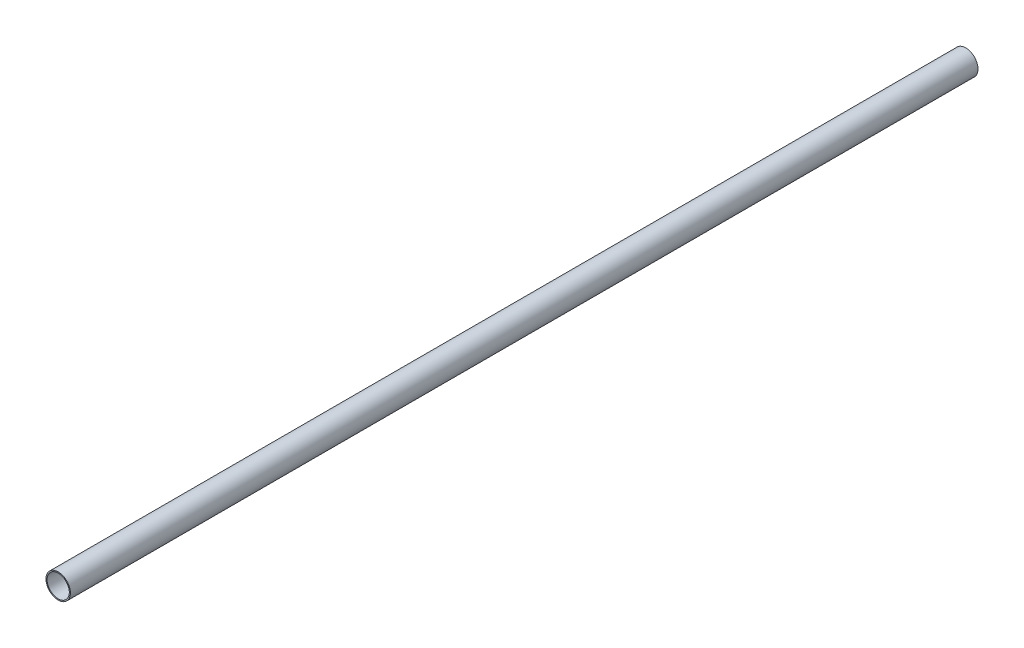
ISO-10303-21;
HEADER;
FILE_DESCRIPTION(('STEP AP214'),'2;1');
FILE_NAME('part.step','',(''),(''),'','','');
FILE_SCHEMA(('AUTOMOTIVE_DESIGN { 1 0 10303 214 1 1 1 1 }'));
ENDSEC;
DATA;
#1=APPLICATION_CONTEXT('core data for automotive mechanical design processes');
#2=APPLICATION_PROTOCOL_DEFINITION('international standard','automotive_design',2000,#1);
#3=PRODUCT_CONTEXT('',#1,'mechanical');
#4=PRODUCT('Part','Part','',(#3));
#5=PRODUCT_RELATED_PRODUCT_CATEGORY('part','',(#4));
#6=PRODUCT_DEFINITION_FORMATION('','',#4);
#7=PRODUCT_DEFINITION_CONTEXT('part definition',#1,'design');
#8=PRODUCT_DEFINITION('design','',#6,#7);
#9=PRODUCT_DEFINITION_SHAPE('','',#8);
#10=(LENGTH_UNIT() NAMED_UNIT(*) SI_UNIT(.MILLI.,.METRE.));
#11=(NAMED_UNIT(*) PLANE_ANGLE_UNIT() SI_UNIT($,.RADIAN.));
#12=(NAMED_UNIT(*) SI_UNIT($,.STERADIAN.) SOLID_ANGLE_UNIT());
#13=UNCERTAINTY_MEASURE_WITH_UNIT(LENGTH_MEASURE(1.E-05),#10,'distance_accuracy_value','');
#14=(GEOMETRIC_REPRESENTATION_CONTEXT(3) GLOBAL_UNCERTAINTY_ASSIGNED_CONTEXT((#13)) GLOBAL_UNIT_ASSIGNED_CONTEXT((#10,
#11,#12)) REPRESENTATION_CONTEXT('',''));
#15=CARTESIAN_POINT('',(0.,0.,0.));
#16=DIRECTION('',(0.,0.,1.));
#17=DIRECTION('',(1.,0.,0.));
#18=AXIS2_PLACEMENT_3D('',#15,#16,#17);
#19=CARTESIAN_POINT('',(0.,0.,122.5));
#20=DIRECTION('',(0.,0.,1.));
#21=DIRECTION('',(1.,0.,0.));
#22=AXIS2_PLACEMENT_3D('',#19,#20,#21);
#23=PLANE('',#22);
#24=CARTESIAN_POINT('',(0.,0.,122.5));
#25=DIRECTION('',(0.,0.,1.));
#26=DIRECTION('',(1.,0.,0.));
#27=AXIS2_PLACEMENT_3D('',#24,#25,#26);
#28=CIRCLE('',#27,3.3);
#29=CARTESIAN_POINT('',(3.3,0.,122.5));
#30=VERTEX_POINT('',#29);
#31=EDGE_CURVE('E10',#30,#30,#28,.T.);
#32=ORIENTED_EDGE('',*,*,#31,.T.);
#33=EDGE_LOOP('',(#32));
#34=FACE_BOUND('',#33,.T.);
#35=CARTESIAN_POINT('',(0.,0.,122.5));
#36=DIRECTION('',(0.,0.,1.));
#37=DIRECTION('',(1.,0.,0.));
#38=AXIS2_PLACEMENT_3D('',#35,#36,#37);
#39=CIRCLE('',#38,3.);
#40=CARTESIAN_POINT('',(3.,0.,122.5));
#41=VERTEX_POINT('',#40);
#42=EDGE_CURVE('E44',#41,#41,#39,.T.);
#43=ORIENTED_EDGE('',*,*,#42,.F.);
#44=EDGE_LOOP('',(#43));
#45=FACE_BOUND('',#44,.T.);
#46=ADVANCED_FACE('F33',(#34,#45),#23,.T.);
#47=CARTESIAN_POINT('',(0.,0.,-122.5));
#48=DIRECTION('',(0.,0.,1.));
#49=DIRECTION('',(1.,0.,0.));
#50=AXIS2_PLACEMENT_3D('',#47,#48,#49);
#51=PLANE('',#50);
#52=CARTESIAN_POINT('',(0.,0.,-122.5));
#53=DIRECTION('',(0.,0.,1.));
#54=DIRECTION('',(1.,0.,0.));
#55=AXIS2_PLACEMENT_3D('',#52,#53,#54);
#56=CIRCLE('',#55,3.3);
#57=CARTESIAN_POINT('',(3.3,0.,-122.5));
#58=VERTEX_POINT('',#57);
#59=EDGE_CURVE('E37',#58,#58,#56,.T.);
#60=ORIENTED_EDGE('',*,*,#59,.F.);
#61=EDGE_LOOP('',(#60));
#62=FACE_BOUND('',#61,.T.);
#63=CARTESIAN_POINT('',(0.,0.,-122.5));
#64=DIRECTION('',(0.,0.,1.));
#65=DIRECTION('',(1.,0.,0.));
#66=AXIS2_PLACEMENT_3D('',#63,#64,#65);
#67=CIRCLE('',#66,3.);
#68=CARTESIAN_POINT('',(3.,0.,-122.5));
#69=VERTEX_POINT('',#68);
#70=EDGE_CURVE('E46',#69,#69,#67,.T.);
#71=ORIENTED_EDGE('',*,*,#70,.T.);
#72=EDGE_LOOP('',(#71));
#73=FACE_BOUND('',#72,.T.);
#74=ADVANCED_FACE('F56',(#62,#73),#51,.F.);
#75=CARTESIAN_POINT('',(0.,0.,122.5));
#76=DIRECTION('',(0.,0.,-1.));
#77=DIRECTION('',(-1.,0.,0.));
#78=AXIS2_PLACEMENT_3D('',#75,#76,#77);
#79=CYLINDRICAL_SURFACE('',#78,3.3);
#80=ORIENTED_EDGE('',*,*,#31,.F.);
#81=EDGE_LOOP('',(#80));
#82=FACE_BOUND('',#81,.T.);
#83=ORIENTED_EDGE('',*,*,#59,.T.);
#84=EDGE_LOOP('',(#83));
#85=FACE_BOUND('',#84,.T.);
#86=ADVANCED_FACE('F35',(#82,#85),#79,.T.);
#87=CARTESIAN_POINT('',(0.,0.,122.5));
#88=DIRECTION('',(0.,0.,-1.));
#89=DIRECTION('',(-1.,0.,0.));
#90=AXIS2_PLACEMENT_3D('',#87,#88,#89);
#91=CYLINDRICAL_SURFACE('',#90,3.);
#92=ORIENTED_EDGE('',*,*,#42,.T.);
#93=EDGE_LOOP('',(#92));
#94=FACE_BOUND('',#93,.T.);
#95=ORIENTED_EDGE('',*,*,#70,.F.);
#96=EDGE_LOOP('',(#95));
#97=FACE_BOUND('',#96,.T.);
#98=ADVANCED_FACE('F52',(#94,#97),#91,.F.);
#99=CLOSED_SHELL('',(#46,#74,#86,#98));
#100=MANIFOLD_SOLID_BREP('B2',#99);
#101=ADVANCED_BREP_SHAPE_REPRESENTATION('',(#18,#100),#14);
#102=SHAPE_DEFINITION_REPRESENTATION(#9,#101);
ENDSEC;
END-ISO-10303-21;
